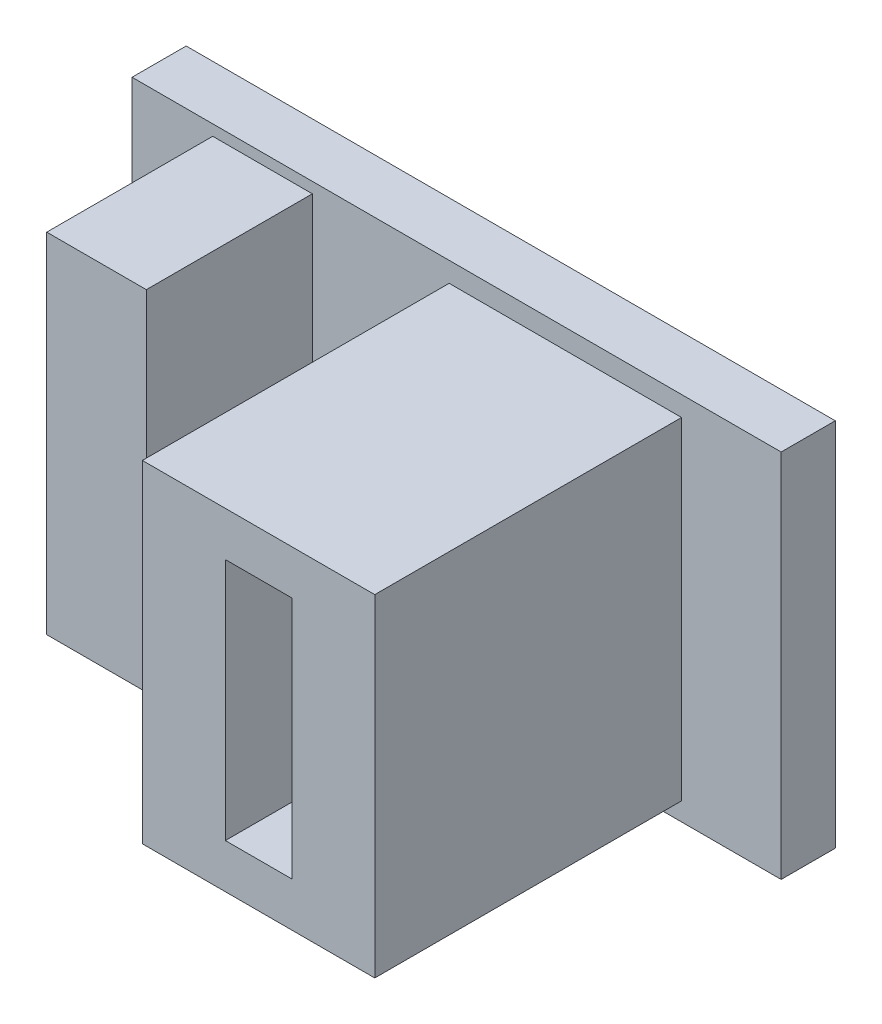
ISO-10303-21;
HEADER;
FILE_DESCRIPTION(('STEP AP214'),'2;1');
FILE_NAME('part.step','',(''),(''),'','','');
FILE_SCHEMA(('AUTOMOTIVE_DESIGN { 1 0 10303 214 1 1 1 1 }'));
ENDSEC;
DATA;
#1=APPLICATION_CONTEXT('core data for automotive mechanical design processes');
#2=APPLICATION_PROTOCOL_DEFINITION('international standard','automotive_design',2000,#1);
#3=PRODUCT_CONTEXT('',#1,'mechanical');
#4=PRODUCT('Part','Part','',(#3));
#5=PRODUCT_RELATED_PRODUCT_CATEGORY('part','',(#4));
#6=PRODUCT_DEFINITION_FORMATION('','',#4);
#7=PRODUCT_DEFINITION_CONTEXT('part definition',#1,'design');
#8=PRODUCT_DEFINITION('design','',#6,#7);
#9=PRODUCT_DEFINITION_SHAPE('','',#8);
#10=(LENGTH_UNIT() NAMED_UNIT(*) SI_UNIT(.MILLI.,.METRE.));
#11=(NAMED_UNIT(*) PLANE_ANGLE_UNIT() SI_UNIT($,.RADIAN.));
#12=(NAMED_UNIT(*) SI_UNIT($,.STERADIAN.) SOLID_ANGLE_UNIT());
#13=UNCERTAINTY_MEASURE_WITH_UNIT(LENGTH_MEASURE(1.E-05),#10,'distance_accuracy_value','');
#14=(GEOMETRIC_REPRESENTATION_CONTEXT(3) GLOBAL_UNCERTAINTY_ASSIGNED_CONTEXT((#13)) GLOBAL_UNIT_ASSIGNED_CONTEXT((#10,
#11,#12)) REPRESENTATION_CONTEXT('',''));
#15=CARTESIAN_POINT('',(0.,0.,0.));
#16=DIRECTION('',(0.,0.,1.));
#17=DIRECTION('',(1.,0.,0.));
#18=AXIS2_PLACEMENT_3D('',#15,#16,#17);
#19=CARTESIAN_POINT('',(0.,11.15,1.63));
#20=DIRECTION('',(0.,0.,-1.));
#21=DIRECTION('',(-1.,0.,0.));
#22=AXIS2_PLACEMENT_3D('',#19,#20,#21);
#23=PLANE('',#22);
#24=DIRECTION('',(0.,1.,0.));
#25=VECTOR('',#24,1.);
#26=CARTESIAN_POINT('',(16.55,0.55,1.63));
#27=LINE('',#26,#25);
#28=CARTESIAN_POINT('',(16.55,0.55,1.63));
#29=VERTEX_POINT('',#28);
#30=CARTESIAN_POINT('',(16.55,10.55,1.63));
#31=VERTEX_POINT('',#30);
#32=EDGE_CURVE('E203',#29,#31,#27,.T.);
#33=ORIENTED_EDGE('',*,*,#32,.F.);
#34=DIRECTION('',(1.,0.,0.));
#35=VECTOR('',#34,1.);
#36=CARTESIAN_POINT('',(16.55,0.55,1.63));
#37=LINE('',#36,#35);
#38=CARTESIAN_POINT('',(9.55,0.55,1.63));
#39=VERTEX_POINT('',#38);
#40=EDGE_CURVE('E218',#39,#29,#37,.T.);
#41=ORIENTED_EDGE('',*,*,#40,.F.);
#42=DIRECTION('',(0.,-1.,0.));
#43=VECTOR('',#42,1.);
#44=CARTESIAN_POINT('',(9.55,0.549999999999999,1.63));
#45=LINE('',#44,#43);
#46=CARTESIAN_POINT('',(9.55,10.55,1.63));
#47=VERTEX_POINT('',#46);
#48=EDGE_CURVE('E215',#47,#39,#45,.T.);
#49=ORIENTED_EDGE('',*,*,#48,.F.);
#50=DIRECTION('',(-1.,0.,0.));
#51=VECTOR('',#50,1.);
#52=CARTESIAN_POINT('',(16.55,10.55,1.63));
#53=LINE('',#52,#51);
#54=EDGE_CURVE('E212',#31,#47,#53,.T.);
#55=ORIENTED_EDGE('',*,*,#54,.F.);
#56=EDGE_LOOP('',(#33,#41,#49,#55));
#57=FACE_BOUND('',#56,.T.);
#58=DIRECTION('',(0.,-1.,0.));
#59=VECTOR('',#58,1.);
#60=CARTESIAN_POINT('',(0.,0.,1.63));
#61=LINE('',#60,#59);
#62=CARTESIAN_POINT('',(0.,11.15,1.63));
#63=VERTEX_POINT('',#62);
#64=CARTESIAN_POINT('',(0.,0.,1.63));
#65=VERTEX_POINT('',#64);
#66=EDGE_CURVE('E251',#63,#65,#61,.T.);
#67=ORIENTED_EDGE('',*,*,#66,.T.);
#68=DIRECTION('',(1.,0.,0.));
#69=VECTOR('',#68,1.);
#70=CARTESIAN_POINT('',(0.,0.,1.63));
#71=LINE('',#70,#69);
#72=CARTESIAN_POINT('',(19.55,0.,1.63));
#73=VERTEX_POINT('',#72);
#74=EDGE_CURVE('E254',#65,#73,#71,.T.);
#75=ORIENTED_EDGE('',*,*,#74,.T.);
#76=DIRECTION('',(0.,1.,0.));
#77=VECTOR('',#76,1.);
#78=CARTESIAN_POINT('',(19.55,0.,1.63));
#79=LINE('',#78,#77);
#80=CARTESIAN_POINT('',(19.55,11.15,1.63));
#81=VERTEX_POINT('',#80);
#82=EDGE_CURVE('E256',#73,#81,#79,.T.);
#83=ORIENTED_EDGE('',*,*,#82,.T.);
#84=DIRECTION('',(-1.,0.,0.));
#85=VECTOR('',#84,1.);
#86=CARTESIAN_POINT('',(0.,11.15,1.63));
#87=LINE('',#86,#85);
#88=EDGE_CURVE('E258',#81,#63,#87,.T.);
#89=ORIENTED_EDGE('',*,*,#88,.T.);
#90=EDGE_LOOP('',(#67,#75,#83,#89));
#91=FACE_BOUND('',#90,.T.);
#92=DIRECTION('',(0.,1.,0.));
#93=VECTOR('',#92,1.);
#94=CARTESIAN_POINT('',(5.43,10.825,1.63));
#95=LINE('',#94,#93);
#96=CARTESIAN_POINT('',(5.43,0.325,1.63));
#97=VERTEX_POINT('',#96);
#98=CARTESIAN_POINT('',(5.43,10.825,1.63));
#99=VERTEX_POINT('',#98);
#100=EDGE_CURVE('E145',#97,#99,#95,.T.);
#101=ORIENTED_EDGE('',*,*,#100,.F.);
#102=DIRECTION('',(1.,0.,0.));
#103=VECTOR('',#102,1.);
#104=CARTESIAN_POINT('',(5.43,0.325,1.63));
#105=LINE('',#104,#103);
#106=CARTESIAN_POINT('',(2.43,0.325000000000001,1.63));
#107=VERTEX_POINT('',#106);
#108=EDGE_CURVE('E147',#107,#97,#105,.T.);
#109=ORIENTED_EDGE('',*,*,#108,.F.);
#110=DIRECTION('',(0.,-1.,0.));
#111=VECTOR('',#110,1.);
#112=CARTESIAN_POINT('',(2.43,10.825,1.63));
#113=LINE('',#112,#111);
#114=CARTESIAN_POINT('',(2.43,10.825,1.63));
#115=VERTEX_POINT('',#114);
#116=EDGE_CURVE('E56',#115,#107,#113,.T.);
#117=ORIENTED_EDGE('',*,*,#116,.F.);
#118=DIRECTION('',(-1.,0.,0.));
#119=VECTOR('',#118,1.);
#120=CARTESIAN_POINT('',(5.43,10.825,1.63));
#121=LINE('',#120,#119);
#122=EDGE_CURVE('E51',#99,#115,#121,.T.);
#123=ORIENTED_EDGE('',*,*,#122,.F.);
#124=EDGE_LOOP('',(#101,#109,#117,#123));
#125=FACE_BOUND('',#124,.T.);
#126=ADVANCED_FACE('F36',(#57,#91,#125),#23,.F.);
#127=CARTESIAN_POINT('',(0.,0.,1.63));
#128=DIRECTION('',(1.,0.,0.));
#129=DIRECTION('',(0.,0.,-1.));
#130=AXIS2_PLACEMENT_3D('',#127,#128,#129);
#131=PLANE('',#130);
#132=DIRECTION('',(0.,-1.,0.));
#133=VECTOR('',#132,1.);
#134=CARTESIAN_POINT('',(0.,0.,0.));
#135=LINE('',#134,#133);
#136=CARTESIAN_POINT('',(0.,11.15,0.));
#137=VERTEX_POINT('',#136);
#138=CARTESIAN_POINT('',(0.,0.,0.));
#139=VERTEX_POINT('',#138);
#140=EDGE_CURVE('E242',#137,#139,#135,.T.);
#141=ORIENTED_EDGE('',*,*,#140,.T.);
#142=DIRECTION('',(0.,0.,-1.));
#143=VECTOR('',#142,1.);
#144=CARTESIAN_POINT('',(0.,0.,1.63));
#145=LINE('',#144,#143);
#146=EDGE_CURVE('E11',#65,#139,#145,.T.);
#147=ORIENTED_EDGE('',*,*,#146,.F.);
#148=ORIENTED_EDGE('',*,*,#66,.F.);
#149=DIRECTION('',(0.,0.,-1.));
#150=VECTOR('',#149,1.);
#151=CARTESIAN_POINT('',(0.,11.15,1.63));
#152=LINE('',#151,#150);
#153=EDGE_CURVE('E260',#63,#137,#152,.T.);
#154=ORIENTED_EDGE('',*,*,#153,.T.);
#155=EDGE_LOOP('',(#141,#147,#148,#154));
#156=FACE_BOUND('',#155,.T.);
#157=ADVANCED_FACE('F38',(#156),#131,.F.);
#158=CARTESIAN_POINT('',(0.,0.,1.63));
#159=DIRECTION('',(0.,1.,0.));
#160=DIRECTION('',(0.,0.,1.));
#161=AXIS2_PLACEMENT_3D('',#158,#159,#160);
#162=PLANE('',#161);
#163=DIRECTION('',(1.,0.,0.));
#164=VECTOR('',#163,1.);
#165=CARTESIAN_POINT('',(0.,0.,0.));
#166=LINE('',#165,#164);
#167=CARTESIAN_POINT('',(19.55,0.,0.));
#168=VERTEX_POINT('',#167);
#169=EDGE_CURVE('E245',#139,#168,#166,.T.);
#170=ORIENTED_EDGE('',*,*,#169,.T.);
#171=DIRECTION('',(0.,0.,-1.));
#172=VECTOR('',#171,1.);
#173=CARTESIAN_POINT('',(19.55,0.,1.63));
#174=LINE('',#173,#172);
#175=EDGE_CURVE('E44',#73,#168,#174,.T.);
#176=ORIENTED_EDGE('',*,*,#175,.F.);
#177=ORIENTED_EDGE('',*,*,#74,.F.);
#178=ORIENTED_EDGE('',*,*,#146,.T.);
#179=EDGE_LOOP('',(#170,#176,#177,#178));
#180=FACE_BOUND('',#179,.T.);
#181=ADVANCED_FACE('F285',(#180),#162,.F.);
#182=CARTESIAN_POINT('',(19.55,0.,1.63));
#183=DIRECTION('',(-1.,0.,0.));
#184=DIRECTION('',(0.,0.,1.));
#185=AXIS2_PLACEMENT_3D('',#182,#183,#184);
#186=PLANE('',#185);
#187=DIRECTION('',(0.,1.,0.));
#188=VECTOR('',#187,1.);
#189=CARTESIAN_POINT('',(19.55,0.,0.));
#190=LINE('',#189,#188);
#191=CARTESIAN_POINT('',(19.55,11.15,0.));
#192=VERTEX_POINT('',#191);
#193=EDGE_CURVE('E247',#168,#192,#190,.T.);
#194=ORIENTED_EDGE('',*,*,#193,.T.);
#195=DIRECTION('',(0.,0.,-1.));
#196=VECTOR('',#195,1.);
#197=CARTESIAN_POINT('',(19.55,11.15,1.63));
#198=LINE('',#197,#196);
#199=EDGE_CURVE('E263',#81,#192,#198,.T.);
#200=ORIENTED_EDGE('',*,*,#199,.F.);
#201=ORIENTED_EDGE('',*,*,#82,.F.);
#202=ORIENTED_EDGE('',*,*,#175,.T.);
#203=EDGE_LOOP('',(#194,#200,#201,#202));
#204=FACE_BOUND('',#203,.T.);
#205=ADVANCED_FACE('F270',(#204),#186,.F.);
#206=CARTESIAN_POINT('',(0.,11.15,1.63));
#207=DIRECTION('',(0.,-1.,0.));
#208=DIRECTION('',(0.,0.,-1.));
#209=AXIS2_PLACEMENT_3D('',#206,#207,#208);
#210=PLANE('',#209);
#211=DIRECTION('',(-1.,0.,0.));
#212=VECTOR('',#211,1.);
#213=CARTESIAN_POINT('',(0.,11.15,0.));
#214=LINE('',#213,#212);
#215=EDGE_CURVE('E249',#192,#137,#214,.T.);
#216=ORIENTED_EDGE('',*,*,#215,.T.);
#217=ORIENTED_EDGE('',*,*,#153,.F.);
#218=ORIENTED_EDGE('',*,*,#88,.F.);
#219=ORIENTED_EDGE('',*,*,#199,.T.);
#220=EDGE_LOOP('',(#216,#217,#218,#219));
#221=FACE_BOUND('',#220,.T.);
#222=ADVANCED_FACE('F279',(#221),#210,.F.);
#223=CARTESIAN_POINT('',(0.,11.15,0.));
#224=DIRECTION('',(0.,0.,-1.));
#225=DIRECTION('',(-1.,0.,0.));
#226=AXIS2_PLACEMENT_3D('',#223,#224,#225);
#227=PLANE('',#226);
#228=ORIENTED_EDGE('',*,*,#140,.F.);
#229=ORIENTED_EDGE('',*,*,#215,.F.);
#230=ORIENTED_EDGE('',*,*,#193,.F.);
#231=ORIENTED_EDGE('',*,*,#169,.F.);
#232=EDGE_LOOP('',(#228,#229,#230,#231));
#233=FACE_BOUND('',#232,.T.);
#234=ADVANCED_FACE('F276',(#233),#227,.T.);
#235=CARTESIAN_POINT('',(16.55,0.55,10.87));
#236=DIRECTION('',(-1.,0.,0.));
#237=DIRECTION('',(0.,0.,1.));
#238=AXIS2_PLACEMENT_3D('',#235,#236,#237);
#239=PLANE('',#238);
#240=ORIENTED_EDGE('',*,*,#32,.T.);
#241=DIRECTION('',(0.,0.,-1.));
#242=VECTOR('',#241,1.);
#243=CARTESIAN_POINT('',(16.55,10.55,10.87));
#244=LINE('',#243,#242);
#245=CARTESIAN_POINT('',(16.55,10.55,10.87));
#246=VERTEX_POINT('',#245);
#247=EDGE_CURVE('E239',#246,#31,#244,.T.);
#248=ORIENTED_EDGE('',*,*,#247,.F.);
#249=DIRECTION('',(0.,1.,0.));
#250=VECTOR('',#249,1.);
#251=CARTESIAN_POINT('',(16.55,0.55,10.87));
#252=LINE('',#251,#250);
#253=CARTESIAN_POINT('',(16.55,0.55,10.87));
#254=VERTEX_POINT('',#253);
#255=EDGE_CURVE('E221',#254,#246,#252,.T.);
#256=ORIENTED_EDGE('',*,*,#255,.F.);
#257=DIRECTION('',(0.,0.,-1.));
#258=VECTOR('',#257,1.);
#259=CARTESIAN_POINT('',(16.55,0.55,10.87));
#260=LINE('',#259,#258);
#261=EDGE_CURVE('E230',#254,#29,#260,.T.);
#262=ORIENTED_EDGE('',*,*,#261,.T.);
#263=EDGE_LOOP('',(#240,#248,#256,#262));
#264=FACE_BOUND('',#263,.T.);
#265=ADVANCED_FACE('F304',(#264),#239,.F.);
#266=CARTESIAN_POINT('',(16.55,10.55,10.87));
#267=DIRECTION('',(0.,-1.,0.));
#268=DIRECTION('',(0.,0.,-1.));
#269=AXIS2_PLACEMENT_3D('',#266,#267,#268);
#270=PLANE('',#269);
#271=ORIENTED_EDGE('',*,*,#54,.T.);
#272=DIRECTION('',(0.,0.,-1.));
#273=VECTOR('',#272,1.);
#274=CARTESIAN_POINT('',(9.55,10.55,10.87));
#275=LINE('',#274,#273);
#276=CARTESIAN_POINT('',(9.55,10.55,10.87));
#277=VERTEX_POINT('',#276);
#278=EDGE_CURVE('E236',#277,#47,#275,.T.);
#279=ORIENTED_EDGE('',*,*,#278,.F.);
#280=DIRECTION('',(-1.,0.,0.));
#281=VECTOR('',#280,1.);
#282=CARTESIAN_POINT('',(16.55,10.55,10.87));
#283=LINE('',#282,#281);
#284=EDGE_CURVE('E224',#246,#277,#283,.T.);
#285=ORIENTED_EDGE('',*,*,#284,.F.);
#286=ORIENTED_EDGE('',*,*,#247,.T.);
#287=EDGE_LOOP('',(#271,#279,#285,#286));
#288=FACE_BOUND('',#287,.T.);
#289=ADVANCED_FACE('F308',(#288),#270,.F.);
#290=CARTESIAN_POINT('',(9.55,0.549999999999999,10.87));
#291=DIRECTION('',(1.,0.,0.));
#292=DIRECTION('',(0.,0.,-1.));
#293=AXIS2_PLACEMENT_3D('',#290,#291,#292);
#294=PLANE('',#293);
#295=ORIENTED_EDGE('',*,*,#48,.T.);
#296=DIRECTION('',(0.,0.,-1.));
#297=VECTOR('',#296,1.);
#298=CARTESIAN_POINT('',(9.55,0.549999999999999,10.87));
#299=LINE('',#298,#297);
#300=CARTESIAN_POINT('',(9.55,0.549999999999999,10.87));
#301=VERTEX_POINT('',#300);
#302=EDGE_CURVE('E233',#301,#39,#299,.T.);
#303=ORIENTED_EDGE('',*,*,#302,.F.);
#304=DIRECTION('',(0.,-1.,0.));
#305=VECTOR('',#304,1.);
#306=CARTESIAN_POINT('',(9.55,0.549999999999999,10.87));
#307=LINE('',#306,#305);
#308=EDGE_CURVE('E226',#277,#301,#307,.T.);
#309=ORIENTED_EDGE('',*,*,#308,.F.);
#310=ORIENTED_EDGE('',*,*,#278,.T.);
#311=EDGE_LOOP('',(#295,#303,#309,#310));
#312=FACE_BOUND('',#311,.T.);
#313=ADVANCED_FACE('F313',(#312),#294,.F.);
#314=CARTESIAN_POINT('',(16.55,0.55,10.87));
#315=DIRECTION('',(0.,1.,0.));
#316=DIRECTION('',(-1.,0.,0.));
#317=AXIS2_PLACEMENT_3D('',#314,#315,#316);
#318=PLANE('',#317);
#319=ORIENTED_EDGE('',*,*,#40,.T.);
#320=ORIENTED_EDGE('',*,*,#261,.F.);
#321=DIRECTION('',(1.,0.,0.));
#322=VECTOR('',#321,1.);
#323=CARTESIAN_POINT('',(16.55,0.55,10.87));
#324=LINE('',#323,#322);
#325=EDGE_CURVE('E228',#301,#254,#324,.T.);
#326=ORIENTED_EDGE('',*,*,#325,.F.);
#327=ORIENTED_EDGE('',*,*,#302,.T.);
#328=EDGE_LOOP('',(#319,#320,#326,#327));
#329=FACE_BOUND('',#328,.T.);
#330=ADVANCED_FACE('F319',(#329),#318,.F.);
#331=CARTESIAN_POINT('',(16.55,10.55,10.87));
#332=DIRECTION('',(0.,0.,1.));
#333=DIRECTION('',(1.,0.,0.));
#334=AXIS2_PLACEMENT_3D('',#331,#332,#333);
#335=PLANE('',#334);
#336=DIRECTION('',(0.,-1.,0.));
#337=VECTOR('',#336,1.);
#338=CARTESIAN_POINT('',(12.05,9.215,10.87));
#339=LINE('',#338,#337);
#340=CARTESIAN_POINT('',(12.05,9.215,10.87));
#341=VERTEX_POINT('',#340);
#342=CARTESIAN_POINT('',(12.05,1.885,10.87));
#343=VERTEX_POINT('',#342);
#344=EDGE_CURVE('E177',#341,#343,#339,.T.);
#345=ORIENTED_EDGE('',*,*,#344,.F.);
#346=DIRECTION('',(-1.,0.,0.));
#347=VECTOR('',#346,1.);
#348=CARTESIAN_POINT('',(12.05,9.215,10.87));
#349=LINE('',#348,#347);
#350=CARTESIAN_POINT('',(14.05,9.215,10.87));
#351=VERTEX_POINT('',#350);
#352=EDGE_CURVE('E185',#351,#341,#349,.T.);
#353=ORIENTED_EDGE('',*,*,#352,.F.);
#354=DIRECTION('',(0.,1.,0.));
#355=VECTOR('',#354,1.);
#356=CARTESIAN_POINT('',(14.05,9.215,10.87));
#357=LINE('',#356,#355);
#358=CARTESIAN_POINT('',(14.05,1.885,10.87));
#359=VERTEX_POINT('',#358);
#360=EDGE_CURVE('E182',#359,#351,#357,.T.);
#361=ORIENTED_EDGE('',*,*,#360,.F.);
#362=DIRECTION('',(1.,0.,0.));
#363=VECTOR('',#362,1.);
#364=CARTESIAN_POINT('',(12.05,1.885,10.87));
#365=LINE('',#364,#363);
#366=EDGE_CURVE('E179',#343,#359,#365,.T.);
#367=ORIENTED_EDGE('',*,*,#366,.F.);
#368=EDGE_LOOP('',(#345,#353,#361,#367));
#369=FACE_BOUND('',#368,.T.);
#370=ORIENTED_EDGE('',*,*,#255,.T.);
#371=ORIENTED_EDGE('',*,*,#284,.T.);
#372=ORIENTED_EDGE('',*,*,#308,.T.);
#373=ORIENTED_EDGE('',*,*,#325,.T.);
#374=EDGE_LOOP('',(#370,#371,#372,#373));
#375=FACE_BOUND('',#374,.T.);
#376=ADVANCED_FACE('F323',(#369,#375),#335,.T.);
#377=CARTESIAN_POINT('',(12.05,9.215,2.49));
#378=DIRECTION('',(-1.,0.,0.));
#379=DIRECTION('',(0.,-1.,0.));
#380=AXIS2_PLACEMENT_3D('',#377,#378,#379);
#381=PLANE('',#380);
#382=ORIENTED_EDGE('',*,*,#344,.T.);
#383=DIRECTION('',(0.,0.,1.));
#384=VECTOR('',#383,1.);
#385=CARTESIAN_POINT('',(12.05,1.885,2.49));
#386=LINE('',#385,#384);
#387=CARTESIAN_POINT('',(12.05,1.885,2.49));
#388=VERTEX_POINT('',#387);
#389=EDGE_CURVE('E200',#388,#343,#386,.T.);
#390=ORIENTED_EDGE('',*,*,#389,.F.);
#391=DIRECTION('',(0.,-1.,0.));
#392=VECTOR('',#391,1.);
#393=CARTESIAN_POINT('',(12.05,9.215,2.49));
#394=LINE('',#393,#392);
#395=CARTESIAN_POINT('',(12.05,9.215,2.49));
#396=VERTEX_POINT('',#395);
#397=EDGE_CURVE('E188',#396,#388,#394,.T.);
#398=ORIENTED_EDGE('',*,*,#397,.F.);
#399=DIRECTION('',(0.,0.,1.));
#400=VECTOR('',#399,1.);
#401=CARTESIAN_POINT('',(12.05,9.215,2.49));
#402=LINE('',#401,#400);
#403=EDGE_CURVE('E201',#396,#341,#402,.T.);
#404=ORIENTED_EDGE('',*,*,#403,.T.);
#405=EDGE_LOOP('',(#382,#390,#398,#404));
#406=FACE_BOUND('',#405,.T.);
#407=ADVANCED_FACE('F327',(#406),#381,.F.);
#408=CARTESIAN_POINT('',(12.05,9.215,2.49));
#409=DIRECTION('',(0.,1.,0.));
#410=DIRECTION('',(0.,0.,1.));
#411=AXIS2_PLACEMENT_3D('',#408,#409,#410);
#412=PLANE('',#411);
#413=ORIENTED_EDGE('',*,*,#352,.T.);
#414=ORIENTED_EDGE('',*,*,#403,.F.);
#415=DIRECTION('',(-1.,0.,0.));
#416=VECTOR('',#415,1.);
#417=CARTESIAN_POINT('',(12.05,9.215,2.49));
#418=LINE('',#417,#416);
#419=CARTESIAN_POINT('',(14.05,9.215,2.49));
#420=VERTEX_POINT('',#419);
#421=EDGE_CURVE('E197',#420,#396,#418,.T.);
#422=ORIENTED_EDGE('',*,*,#421,.F.);
#423=DIRECTION('',(0.,0.,1.));
#424=VECTOR('',#423,1.);
#425=CARTESIAN_POINT('',(14.05,9.215,2.49));
#426=LINE('',#425,#424);
#427=EDGE_CURVE('E204',#420,#351,#426,.T.);
#428=ORIENTED_EDGE('',*,*,#427,.T.);
#429=EDGE_LOOP('',(#413,#414,#422,#428));
#430=FACE_BOUND('',#429,.T.);
#431=ADVANCED_FACE('F331',(#430),#412,.F.);
#432=CARTESIAN_POINT('',(14.05,9.215,2.49));
#433=DIRECTION('',(1.,0.,0.));
#434=DIRECTION('',(0.,0.,-1.));
#435=AXIS2_PLACEMENT_3D('',#432,#433,#434);
#436=PLANE('',#435);
#437=ORIENTED_EDGE('',*,*,#360,.T.);
#438=ORIENTED_EDGE('',*,*,#427,.F.);
#439=DIRECTION('',(0.,1.,0.));
#440=VECTOR('',#439,1.);
#441=CARTESIAN_POINT('',(14.05,9.215,2.49));
#442=LINE('',#441,#440);
#443=CARTESIAN_POINT('',(14.05,1.885,2.49));
#444=VERTEX_POINT('',#443);
#445=EDGE_CURVE('E194',#444,#420,#442,.T.);
#446=ORIENTED_EDGE('',*,*,#445,.F.);
#447=DIRECTION('',(0.,0.,1.));
#448=VECTOR('',#447,1.);
#449=CARTESIAN_POINT('',(14.05,1.885,2.49));
#450=LINE('',#449,#448);
#451=EDGE_CURVE('E206',#444,#359,#450,.T.);
#452=ORIENTED_EDGE('',*,*,#451,.T.);
#453=EDGE_LOOP('',(#437,#438,#446,#452));
#454=FACE_BOUND('',#453,.T.);
#455=ADVANCED_FACE('F337',(#454),#436,.F.);
#456=CARTESIAN_POINT('',(12.05,1.885,2.49));
#457=DIRECTION('',(0.,-1.,0.));
#458=DIRECTION('',(0.,0.,-1.));
#459=AXIS2_PLACEMENT_3D('',#456,#457,#458);
#460=PLANE('',#459);
#461=ORIENTED_EDGE('',*,*,#366,.T.);
#462=ORIENTED_EDGE('',*,*,#451,.F.);
#463=DIRECTION('',(1.,0.,0.));
#464=VECTOR('',#463,1.);
#465=CARTESIAN_POINT('',(12.05,1.885,2.49));
#466=LINE('',#465,#464);
#467=EDGE_CURVE('E191',#388,#444,#466,.T.);
#468=ORIENTED_EDGE('',*,*,#467,.F.);
#469=ORIENTED_EDGE('',*,*,#389,.T.);
#470=EDGE_LOOP('',(#461,#462,#468,#469));
#471=FACE_BOUND('',#470,.T.);
#472=ADVANCED_FACE('F333',(#471),#460,.F.);
#473=CARTESIAN_POINT('',(12.05,1.885,2.49));
#474=DIRECTION('',(0.,0.,1.));
#475=DIRECTION('',(1.,0.,0.));
#476=AXIS2_PLACEMENT_3D('',#473,#474,#475);
#477=PLANE('',#476);
#478=ORIENTED_EDGE('',*,*,#397,.T.);
#479=ORIENTED_EDGE('',*,*,#467,.T.);
#480=ORIENTED_EDGE('',*,*,#445,.T.);
#481=ORIENTED_EDGE('',*,*,#421,.T.);
#482=EDGE_LOOP('',(#478,#479,#480,#481));
#483=FACE_BOUND('',#482,.T.);
#484=ADVANCED_FACE('F336',(#483),#477,.T.);
#485=CARTESIAN_POINT('',(5.43,10.825,6.63));
#486=DIRECTION('',(-1.,0.,0.));
#487=DIRECTION('',(0.,-1.,0.));
#488=AXIS2_PLACEMENT_3D('',#485,#486,#487);
#489=PLANE('',#488);
#490=ORIENTED_EDGE('',*,*,#100,.T.);
#491=DIRECTION('',(0.,0.,-1.));
#492=VECTOR('',#491,1.);
#493=CARTESIAN_POINT('',(5.43,10.825,6.63));
#494=LINE('',#493,#492);
#495=CARTESIAN_POINT('',(5.43,10.825,6.63));
#496=VERTEX_POINT('',#495);
#497=EDGE_CURVE('E175',#496,#99,#494,.T.);
#498=ORIENTED_EDGE('',*,*,#497,.F.);
#499=DIRECTION('',(0.,1.,0.));
#500=VECTOR('',#499,1.);
#501=CARTESIAN_POINT('',(5.43,10.825,6.63));
#502=LINE('',#501,#500);
#503=CARTESIAN_POINT('',(5.43,0.325,6.63));
#504=VERTEX_POINT('',#503);
#505=EDGE_CURVE('E161',#504,#496,#502,.T.);
#506=ORIENTED_EDGE('',*,*,#505,.F.);
#507=DIRECTION('',(0.,0.,-1.));
#508=VECTOR('',#507,1.);
#509=CARTESIAN_POINT('',(5.43,0.325,6.63));
#510=LINE('',#509,#508);
#511=EDGE_CURVE('E157',#504,#97,#510,.T.);
#512=ORIENTED_EDGE('',*,*,#511,.T.);
#513=EDGE_LOOP('',(#490,#498,#506,#512));
#514=FACE_BOUND('',#513,.T.);
#515=ADVANCED_FACE('F163',(#514),#489,.F.);
#516=CARTESIAN_POINT('',(5.43,10.825,6.63));
#517=DIRECTION('',(0.,-1.,0.));
#518=DIRECTION('',(0.,0.,-1.));
#519=AXIS2_PLACEMENT_3D('',#516,#517,#518);
#520=PLANE('',#519);
#521=ORIENTED_EDGE('',*,*,#122,.T.);
#522=DIRECTION('',(0.,0.,-1.));
#523=VECTOR('',#522,1.);
#524=CARTESIAN_POINT('',(2.43,10.825,6.63));
#525=LINE('',#524,#523);
#526=CARTESIAN_POINT('',(2.43,10.825,6.63));
#527=VERTEX_POINT('',#526);
#528=EDGE_CURVE('E167',#527,#115,#525,.T.);
#529=ORIENTED_EDGE('',*,*,#528,.F.);
#530=DIRECTION('',(-1.,0.,0.));
#531=VECTOR('',#530,1.);
#532=CARTESIAN_POINT('',(5.43,10.825,6.63));
#533=LINE('',#532,#531);
#534=EDGE_CURVE('E365',#496,#527,#533,.T.);
#535=ORIENTED_EDGE('',*,*,#534,.F.);
#536=ORIENTED_EDGE('',*,*,#497,.T.);
#537=EDGE_LOOP('',(#521,#529,#535,#536));
#538=FACE_BOUND('',#537,.T.);
#539=ADVANCED_FACE('F350',(#538),#520,.F.);
#540=CARTESIAN_POINT('',(2.43,10.825,6.63));
#541=DIRECTION('',(1.,0.,0.));
#542=DIRECTION('',(0.,1.,0.));
#543=AXIS2_PLACEMENT_3D('',#540,#541,#542);
#544=PLANE('',#543);
#545=ORIENTED_EDGE('',*,*,#116,.T.);
#546=DIRECTION('',(0.,0.,-1.));
#547=VECTOR('',#546,1.);
#548=CARTESIAN_POINT('',(2.43,0.325,6.63));
#549=LINE('',#548,#547);
#550=CARTESIAN_POINT('',(2.43,0.325,6.63));
#551=VERTEX_POINT('',#550);
#552=EDGE_CURVE('E160',#551,#107,#549,.T.);
#553=ORIENTED_EDGE('',*,*,#552,.F.);
#554=DIRECTION('',(0.,-1.,0.));
#555=VECTOR('',#554,1.);
#556=CARTESIAN_POINT('',(2.43,10.825,6.63));
#557=LINE('',#556,#555);
#558=EDGE_CURVE('E169',#527,#551,#557,.T.);
#559=ORIENTED_EDGE('',*,*,#558,.F.);
#560=ORIENTED_EDGE('',*,*,#528,.T.);
#561=EDGE_LOOP('',(#545,#553,#559,#560));
#562=FACE_BOUND('',#561,.T.);
#563=ADVANCED_FACE('F353',(#562),#544,.F.);
#564=CARTESIAN_POINT('',(5.43,0.325,6.63));
#565=DIRECTION('',(0.,1.,0.));
#566=DIRECTION('',(-1.,0.,0.));
#567=AXIS2_PLACEMENT_3D('',#564,#565,#566);
#568=PLANE('',#567);
#569=ORIENTED_EDGE('',*,*,#108,.T.);
#570=ORIENTED_EDGE('',*,*,#511,.F.);
#571=DIRECTION('',(1.,0.,0.));
#572=VECTOR('',#571,1.);
#573=CARTESIAN_POINT('',(5.43,0.325,6.63));
#574=LINE('',#573,#572);
#575=EDGE_CURVE('E165',#551,#504,#574,.T.);
#576=ORIENTED_EDGE('',*,*,#575,.F.);
#577=ORIENTED_EDGE('',*,*,#552,.T.);
#578=EDGE_LOOP('',(#569,#570,#576,#577));
#579=FACE_BOUND('',#578,.T.);
#580=ADVANCED_FACE('F155',(#579),#568,.F.);
#581=CARTESIAN_POINT('',(5.43,0.325,6.63));
#582=DIRECTION('',(0.,0.,-1.));
#583=DIRECTION('',(-1.,0.,0.));
#584=AXIS2_PLACEMENT_3D('',#581,#582,#583);
#585=PLANE('',#584);
#586=ORIENTED_EDGE('',*,*,#505,.T.);
#587=ORIENTED_EDGE('',*,*,#534,.T.);
#588=ORIENTED_EDGE('',*,*,#558,.T.);
#589=ORIENTED_EDGE('',*,*,#575,.T.);
#590=EDGE_LOOP('',(#586,#587,#588,#589));
#591=FACE_BOUND('',#590,.T.);
#592=ADVANCED_FACE('F360',(#591),#585,.F.);
#593=CLOSED_SHELL('',(#126,#157,#181,#205,#222,#234,#265,#289,#313,#330,#376,#407,#431,#455,
#472,#484,#515,#539,#563,#580,#592));
#594=MANIFOLD_SOLID_BREP('B2',#593);
#595=ADVANCED_BREP_SHAPE_REPRESENTATION('',(#18,#594),#14);
#596=SHAPE_DEFINITION_REPRESENTATION(#9,#595);
ENDSEC;
END-ISO-10303-21;
